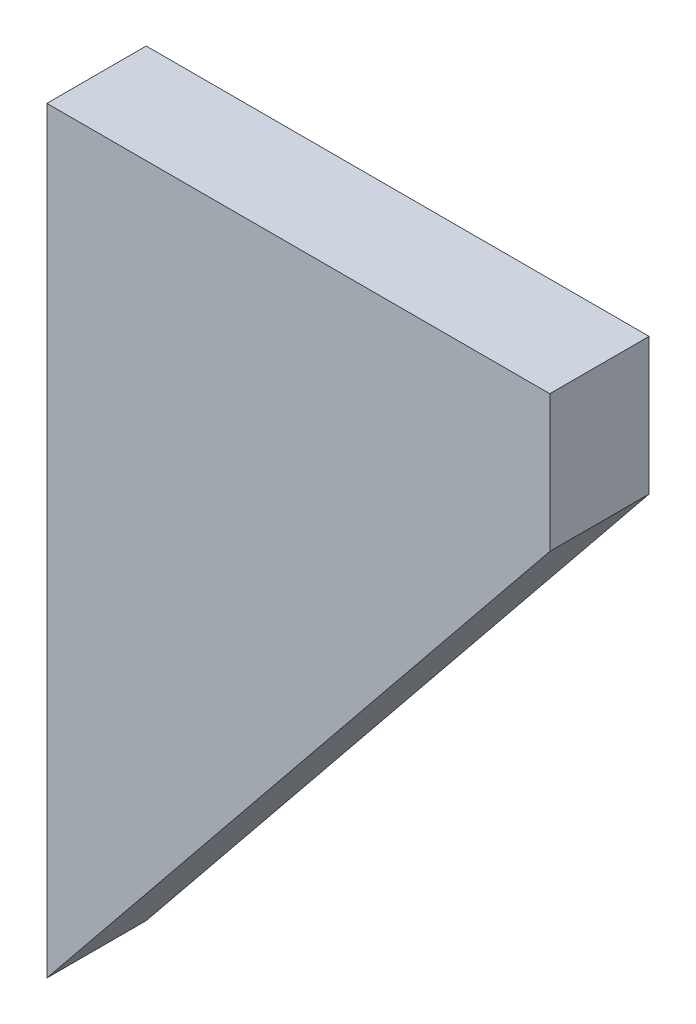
ISO-10303-21;
HEADER;
FILE_DESCRIPTION(('STEP AP214'),'2;1');
FILE_NAME('part.step','',(''),(''),'','','');
FILE_SCHEMA(('AUTOMOTIVE_DESIGN { 1 0 10303 214 1 1 1 1 }'));
ENDSEC;
DATA;
#1=APPLICATION_CONTEXT('core data for automotive mechanical design processes');
#2=APPLICATION_PROTOCOL_DEFINITION('international standard','automotive_design',2000,#1);
#3=PRODUCT_CONTEXT('',#1,'mechanical');
#4=PRODUCT('Part','Part','',(#3));
#5=PRODUCT_RELATED_PRODUCT_CATEGORY('part','',(#4));
#6=PRODUCT_DEFINITION_FORMATION('','',#4);
#7=PRODUCT_DEFINITION_CONTEXT('part definition',#1,'design');
#8=PRODUCT_DEFINITION('design','',#6,#7);
#9=PRODUCT_DEFINITION_SHAPE('','',#8);
#10=(LENGTH_UNIT() NAMED_UNIT(*) SI_UNIT(.MILLI.,.METRE.));
#11=(NAMED_UNIT(*) PLANE_ANGLE_UNIT() SI_UNIT($,.RADIAN.));
#12=(NAMED_UNIT(*) SI_UNIT($,.STERADIAN.) SOLID_ANGLE_UNIT());
#13=UNCERTAINTY_MEASURE_WITH_UNIT(LENGTH_MEASURE(1.E-05),#10,'distance_accuracy_value','');
#14=(GEOMETRIC_REPRESENTATION_CONTEXT(3) GLOBAL_UNCERTAINTY_ASSIGNED_CONTEXT((#13)) GLOBAL_UNIT_ASSIGNED_CONTEXT((#10,
#11,#12)) REPRESENTATION_CONTEXT('',''));
#15=CARTESIAN_POINT('',(0.,0.,0.));
#16=DIRECTION('',(0.,0.,1.));
#17=DIRECTION('',(1.,0.,0.));
#18=AXIS2_PLACEMENT_3D('',#15,#16,#17);
#19=CARTESIAN_POINT('',(40.5,50.,8.));
#20=DIRECTION('',(-0.777063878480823,0.629421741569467,0.));
#21=DIRECTION('',(-0.629421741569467,-0.777063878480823,0.));
#22=AXIS2_PLACEMENT_3D('',#19,#20,#21);
#23=PLANE('',#22);
#24=DIRECTION('',(0.629421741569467,0.777063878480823,0.));
#25=VECTOR('',#24,1.);
#26=CARTESIAN_POINT('',(40.5,50.,0.));
#27=LINE('',#26,#25);
#28=CARTESIAN_POINT('',(0.,0.,0.));
#29=VERTEX_POINT('',#28);
#30=CARTESIAN_POINT('',(40.5,50.,0.));
#31=VERTEX_POINT('',#30);
#32=EDGE_CURVE('E94',#29,#31,#27,.T.);
#33=ORIENTED_EDGE('',*,*,#32,.T.);
#34=DIRECTION('',(0.,0.,-1.));
#35=VECTOR('',#34,1.);
#36=CARTESIAN_POINT('',(40.5,50.,8.));
#37=LINE('',#36,#35);
#38=CARTESIAN_POINT('',(40.5,50.,8.));
#39=VERTEX_POINT('',#38);
#40=EDGE_CURVE('E11',#39,#31,#37,.T.);
#41=ORIENTED_EDGE('',*,*,#40,.F.);
#42=DIRECTION('',(0.629421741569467,0.777063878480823,0.));
#43=VECTOR('',#42,1.);
#44=CARTESIAN_POINT('',(40.5,50.,8.));
#45=LINE('',#44,#43);
#46=CARTESIAN_POINT('',(0.,0.,8.));
#47=VERTEX_POINT('',#46);
#48=EDGE_CURVE('E82',#47,#39,#45,.T.);
#49=ORIENTED_EDGE('',*,*,#48,.F.);
#50=DIRECTION('',(0.,0.,-1.));
#51=VECTOR('',#50,1.);
#52=CARTESIAN_POINT('',(0.,0.,8.));
#53=LINE('',#52,#51);
#54=EDGE_CURVE('E90',#47,#29,#53,.T.);
#55=ORIENTED_EDGE('',*,*,#54,.T.);
#56=EDGE_LOOP('',(#33,#41,#49,#55));
#57=FACE_BOUND('',#56,.T.);
#58=ADVANCED_FACE('F31',(#57),#23,.F.);
#59=CARTESIAN_POINT('',(40.5,61.,8.));
#60=DIRECTION('',(-1.,0.,0.));
#61=DIRECTION('',(0.,0.,1.));
#62=AXIS2_PLACEMENT_3D('',#59,#60,#61);
#63=PLANE('',#62);
#64=DIRECTION('',(0.,1.,0.));
#65=VECTOR('',#64,1.);
#66=CARTESIAN_POINT('',(40.5,61.,0.));
#67=LINE('',#66,#65);
#68=CARTESIAN_POINT('',(40.5,61.,0.));
#69=VERTEX_POINT('',#68);
#70=EDGE_CURVE('E86',#31,#69,#67,.T.);
#71=ORIENTED_EDGE('',*,*,#70,.T.);
#72=DIRECTION('',(0.,0.,-1.));
#73=VECTOR('',#72,1.);
#74=CARTESIAN_POINT('',(40.5,61.,8.));
#75=LINE('',#74,#73);
#76=CARTESIAN_POINT('',(40.5,61.,8.));
#77=VERTEX_POINT('',#76);
#78=EDGE_CURVE('E39',#77,#69,#75,.T.);
#79=ORIENTED_EDGE('',*,*,#78,.F.);
#80=DIRECTION('',(0.,1.,0.));
#81=VECTOR('',#80,1.);
#82=CARTESIAN_POINT('',(40.5,61.,8.));
#83=LINE('',#82,#81);
#84=EDGE_CURVE('E77',#39,#77,#83,.T.);
#85=ORIENTED_EDGE('',*,*,#84,.F.);
#86=ORIENTED_EDGE('',*,*,#40,.T.);
#87=EDGE_LOOP('',(#71,#79,#85,#86));
#88=FACE_BOUND('',#87,.T.);
#89=ADVANCED_FACE('F85',(#88),#63,.F.);
#90=CARTESIAN_POINT('',(0.,61.,8.));
#91=DIRECTION('',(0.,-1.,0.));
#92=DIRECTION('',(0.,0.,-1.));
#93=AXIS2_PLACEMENT_3D('',#90,#91,#92);
#94=PLANE('',#93);
#95=DIRECTION('',(-1.,0.,0.));
#96=VECTOR('',#95,1.);
#97=CARTESIAN_POINT('',(0.,61.,0.));
#98=LINE('',#97,#96);
#99=CARTESIAN_POINT('',(0.,61.,0.));
#100=VERTEX_POINT('',#99);
#101=EDGE_CURVE('E64',#69,#100,#98,.T.);
#102=ORIENTED_EDGE('',*,*,#101,.T.);
#103=DIRECTION('',(0.,0.,-1.));
#104=VECTOR('',#103,1.);
#105=CARTESIAN_POINT('',(0.,61.,8.));
#106=LINE('',#105,#104);
#107=CARTESIAN_POINT('',(0.,61.,8.));
#108=VERTEX_POINT('',#107);
#109=EDGE_CURVE('E87',#108,#100,#106,.T.);
#110=ORIENTED_EDGE('',*,*,#109,.F.);
#111=DIRECTION('',(-1.,0.,0.));
#112=VECTOR('',#111,1.);
#113=CARTESIAN_POINT('',(0.,61.,8.));
#114=LINE('',#113,#112);
#115=EDGE_CURVE('E80',#77,#108,#114,.T.);
#116=ORIENTED_EDGE('',*,*,#115,.F.);
#117=ORIENTED_EDGE('',*,*,#78,.T.);
#118=EDGE_LOOP('',(#102,#110,#116,#117));
#119=FACE_BOUND('',#118,.T.);
#120=ADVANCED_FACE('F88',(#119),#94,.F.);
#121=CARTESIAN_POINT('',(0.,0.,8.));
#122=DIRECTION('',(1.,0.,0.));
#123=DIRECTION('',(0.,0.,-1.));
#124=AXIS2_PLACEMENT_3D('',#121,#122,#123);
#125=PLANE('',#124);
#126=DIRECTION('',(0.,-1.,0.));
#127=VECTOR('',#126,1.);
#128=CARTESIAN_POINT('',(0.,0.,0.));
#129=LINE('',#128,#127);
#130=EDGE_CURVE('E70',#100,#29,#129,.T.);
#131=ORIENTED_EDGE('',*,*,#130,.T.);
#132=ORIENTED_EDGE('',*,*,#54,.F.);
#133=DIRECTION('',(0.,-1.,0.));
#134=VECTOR('',#133,1.);
#135=CARTESIAN_POINT('',(0.,0.,8.));
#136=LINE('',#135,#134);
#137=EDGE_CURVE('E47',#108,#47,#136,.T.);
#138=ORIENTED_EDGE('',*,*,#137,.F.);
#139=ORIENTED_EDGE('',*,*,#109,.T.);
#140=EDGE_LOOP('',(#131,#132,#138,#139));
#141=FACE_BOUND('',#140,.T.);
#142=ADVANCED_FACE('F101',(#141),#125,.F.);
#143=CARTESIAN_POINT('',(49.41,61.,8.));
#144=DIRECTION('',(0.,0.,1.));
#145=DIRECTION('',(1.,0.,0.));
#146=AXIS2_PLACEMENT_3D('',#143,#144,#145);
#147=PLANE('',#146);
#148=ORIENTED_EDGE('',*,*,#48,.T.);
#149=ORIENTED_EDGE('',*,*,#84,.T.);
#150=ORIENTED_EDGE('',*,*,#115,.T.);
#151=ORIENTED_EDGE('',*,*,#137,.T.);
#152=EDGE_LOOP('',(#148,#149,#150,#151));
#153=FACE_BOUND('',#152,.T.);
#154=ADVANCED_FACE('F78',(#153),#147,.T.);
#155=CARTESIAN_POINT('',(49.41,61.,0.));
#156=DIRECTION('',(0.,0.,1.));
#157=DIRECTION('',(1.,0.,0.));
#158=AXIS2_PLACEMENT_3D('',#155,#156,#157);
#159=PLANE('',#158);
#160=ORIENTED_EDGE('',*,*,#32,.F.);
#161=ORIENTED_EDGE('',*,*,#130,.F.);
#162=ORIENTED_EDGE('',*,*,#101,.F.);
#163=ORIENTED_EDGE('',*,*,#70,.F.);
#164=EDGE_LOOP('',(#160,#161,#162,#163));
#165=FACE_BOUND('',#164,.T.);
#166=ADVANCED_FACE('F104',(#165),#159,.F.);
#167=CLOSED_SHELL('',(#58,#89,#120,#142,#154,#166));
#168=MANIFOLD_SOLID_BREP('B2',#167);
#169=ADVANCED_BREP_SHAPE_REPRESENTATION('',(#18,#168),#14);
#170=SHAPE_DEFINITION_REPRESENTATION(#9,#169);
ENDSEC;
END-ISO-10303-21;
